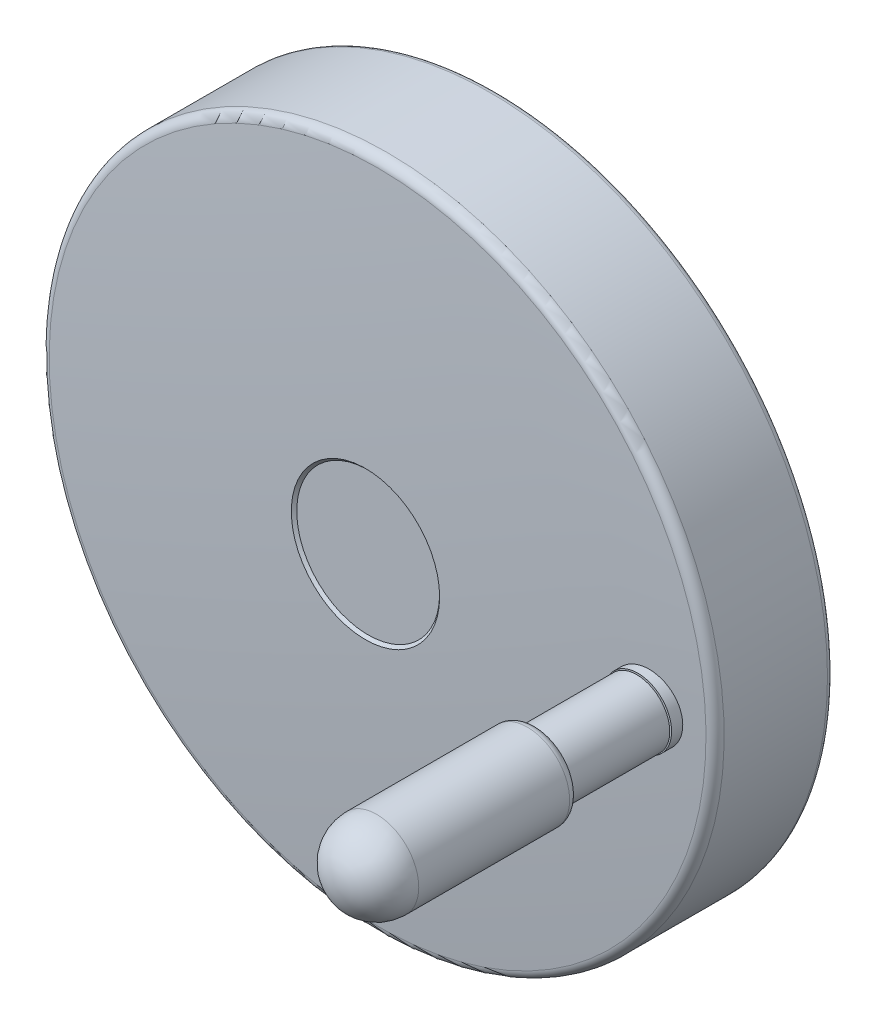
ISO-10303-21;
HEADER;
FILE_DESCRIPTION(('STEP AP214'),'2;1');
FILE_NAME('part.step','',(''),(''),'','','');
FILE_SCHEMA(('AUTOMOTIVE_DESIGN { 1 0 10303 214 1 1 1 1 }'));
ENDSEC;
DATA;
#1=APPLICATION_CONTEXT('core data for automotive mechanical design processes');
#2=APPLICATION_PROTOCOL_DEFINITION('international standard','automotive_design',2000,#1);
#3=PRODUCT_CONTEXT('',#1,'mechanical');
#4=PRODUCT('Part','Part','',(#3));
#5=PRODUCT_RELATED_PRODUCT_CATEGORY('part','',(#4));
#6=PRODUCT_DEFINITION_FORMATION('','',#4);
#7=PRODUCT_DEFINITION_CONTEXT('part definition',#1,'design');
#8=PRODUCT_DEFINITION('design','',#6,#7);
#9=PRODUCT_DEFINITION_SHAPE('','',#8);
#10=(LENGTH_UNIT() NAMED_UNIT(*) SI_UNIT(.MILLI.,.METRE.));
#11=(NAMED_UNIT(*) PLANE_ANGLE_UNIT() SI_UNIT($,.RADIAN.));
#12=(NAMED_UNIT(*) SI_UNIT($,.STERADIAN.) SOLID_ANGLE_UNIT());
#13=UNCERTAINTY_MEASURE_WITH_UNIT(LENGTH_MEASURE(1.E-05),#10,'distance_accuracy_value','');
#14=(GEOMETRIC_REPRESENTATION_CONTEXT(3) GLOBAL_UNCERTAINTY_ASSIGNED_CONTEXT((#13)) GLOBAL_UNIT_ASSIGNED_CONTEXT((#10,
#11,#12)) REPRESENTATION_CONTEXT('',''));
#15=CARTESIAN_POINT('',(0.,0.,0.));
#16=DIRECTION('',(0.,0.,1.));
#17=DIRECTION('',(1.,0.,0.));
#18=AXIS2_PLACEMENT_3D('',#15,#16,#17);
#19=CARTESIAN_POINT('',(0.,0.,53.));
#20=DIRECTION('',(0.,0.,1.));
#21=DIRECTION('',(0.,1.,0.));
#22=AXIS2_PLACEMENT_3D('',#19,#20,#21);
#23=PLANE('',#22);
#24=CARTESIAN_POINT('',(81.,0.,53.));
#25=DIRECTION('',(0.,0.,1.));
#26=DIRECTION('',(0.,1.,0.));
#27=AXIS2_PLACEMENT_3D('',#24,#25,#26);
#28=CIRCLE('',#27,7.3125);
#29=CARTESIAN_POINT('',(81.,7.31249999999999,53.));
#30=VERTEX_POINT('',#29);
#31=EDGE_CURVE('E791',#30,#30,#28,.T.);
#32=ORIENTED_EDGE('',*,*,#31,.F.);
#33=EDGE_LOOP('',(#32));
#34=FACE_BOUND('',#33,.T.);
#35=CARTESIAN_POINT('',(81.,0.,53.));
#36=DIRECTION('',(0.,0.,-1.));
#37=DIRECTION('',(0.,-1.,0.));
#38=AXIS2_PLACEMENT_3D('',#35,#36,#37);
#39=CIRCLE('',#38,10.);
#40=CARTESIAN_POINT('',(81.,-10.,53.));
#41=VERTEX_POINT('',#40);
#42=EDGE_CURVE('E813',#41,#41,#39,.T.);
#43=ORIENTED_EDGE('',*,*,#42,.F.);
#44=EDGE_LOOP('',(#43));
#45=FACE_BOUND('',#44,.T.);
#46=ADVANCED_FACE('F16',(#34,#45),#23,.T.);
#47=CARTESIAN_POINT('',(81.,0.,49.));
#48=DIRECTION('',(0.,0.,-1.));
#49=DIRECTION('',(0.,-1.,0.));
#50=AXIS2_PLACEMENT_3D('',#47,#48,#49);
#51=CYLINDRICAL_SURFACE('',#50,10.);
#52=CARTESIAN_POINT('',(71.,0.,50.9851999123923));
#53=CARTESIAN_POINT('',(71.0000015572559,0.280303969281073,50.9851998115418));
#54=CARTESIAN_POINT('',(71.0117955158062,0.560658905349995,50.9844355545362));
#55=CARTESIAN_POINT('',(71.0589019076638,1.11948955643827,50.9813830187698));
#56=CARTESIAN_POINT('',(71.0942259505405,1.39796427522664,50.9790939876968));
#57=CARTESIAN_POINT('',(71.1882369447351,1.95147310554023,50.973001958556));
#58=CARTESIAN_POINT('',(71.2469678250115,2.22649973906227,50.9691961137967));
#59=CARTESIAN_POINT('',(71.3873705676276,2.77061447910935,50.9600977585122));
#60=CARTESIAN_POINT('',(71.4690430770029,3.03970241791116,50.9548052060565));
#61=CARTESIAN_POINT('',(71.6546550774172,3.56977779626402,50.9427770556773));
#62=CARTESIAN_POINT('',(71.7585742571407,3.83077237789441,50.936042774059));
#63=CARTESIAN_POINT('',(71.9879803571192,4.34307197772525,50.921176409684));
#64=CARTESIAN_POINT('',(72.1134679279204,4.59437670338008,50.9130442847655));
#65=CARTESIAN_POINT('',(72.3850435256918,5.08539078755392,50.8954448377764));
#66=CARTESIAN_POINT('',(72.5311216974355,5.32510562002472,50.8859781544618));
#67=CARTESIAN_POINT('',(72.8428754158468,5.79136990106,50.8657745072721));
#68=CARTESIAN_POINT('',(73.0085505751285,6.01791960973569,50.8550375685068));
#69=CARTESIAN_POINT('',(73.358515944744,6.45650987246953,50.8323569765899));
#70=CARTESIAN_POINT('',(73.5428270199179,6.66853370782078,50.8204119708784));
#71=CARTESIAN_POINT('',(73.928591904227,7.0762955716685,50.7954105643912));
#72=CARTESIAN_POINT('',(74.1300457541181,7.2720335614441,50.7823541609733));
#73=CARTESIAN_POINT('',(74.5486795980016,7.64586313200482,50.7552216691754));
#74=CARTESIAN_POINT('',(74.7658610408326,7.82395308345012,50.7411454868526));
#75=CARTESIAN_POINT('',(75.2143889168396,8.16121532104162,50.7120745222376));
#76=CARTESIAN_POINT('',(75.4457353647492,8.32038758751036,50.69707973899));
#77=CARTESIAN_POINT('',(75.9214132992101,8.61898881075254,50.6662479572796));
#78=CARTESIAN_POINT('',(76.1657691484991,8.75837879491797,50.6504093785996));
#79=CARTESIAN_POINT('',(76.6653145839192,9.01606843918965,50.6180293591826));
#80=CARTESIAN_POINT('',(76.9205041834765,9.13436807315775,50.6014879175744));
#81=CARTESIAN_POINT('',(77.4399046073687,9.34904736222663,50.5678195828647));
#82=CARTESIAN_POINT('',(77.7041154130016,9.44542706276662,50.5506926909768));
#83=CARTESIAN_POINT('',(78.2396856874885,9.61559218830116,50.5159747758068));
#84=CARTESIAN_POINT('',(78.5110451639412,9.68937758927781,50.4983837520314));
#85=CARTESIAN_POINT('',(79.0595035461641,9.81395447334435,50.4628288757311));
#86=CARTESIAN_POINT('',(79.3366122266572,9.86470274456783,50.4448643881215));
#87=CARTESIAN_POINT('',(79.894108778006,9.94264674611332,50.4087220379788));
#88=CARTESIAN_POINT('',(80.1744966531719,9.96984244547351,50.3905441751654));
#89=CARTESIAN_POINT('',(80.7365632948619,10.0004907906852,50.354103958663));
#90=CARTESIAN_POINT('',(81.0182420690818,10.0039432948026,50.3358416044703));
#91=CARTESIAN_POINT('',(81.5808902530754,9.98708070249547,50.2993620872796));
#92=CARTESIAN_POINT('',(81.861859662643,9.96676559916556,50.2811449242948));
#93=CARTESIAN_POINT('',(82.4213543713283,9.90248032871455,50.2448682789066));
#94=CARTESIAN_POINT('',(82.6998771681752,9.85848828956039,50.2268089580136));
#95=CARTESIAN_POINT('',(83.2522337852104,9.7471440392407,50.1909935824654));
#96=CARTESIAN_POINT('',(83.5260676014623,9.67979180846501,50.1732375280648));
#97=CARTESIAN_POINT('',(84.067099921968,9.52219967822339,50.1381549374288));
#98=CARTESIAN_POINT('',(84.3342983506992,9.43195951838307,50.120828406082));
#99=CARTESIAN_POINT('',(84.8601522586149,9.22922695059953,50.0867286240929));
#100=CARTESIAN_POINT('',(85.118807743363,9.11673455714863,50.0699553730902));
#101=CARTESIAN_POINT('',(85.6256350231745,8.87033637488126,50.037088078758));
#102=CARTESIAN_POINT('',(85.8738107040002,8.7364386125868,50.0209937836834));
#103=CARTESIAN_POINT('',(86.3580083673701,8.44814396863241,49.9895927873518));
#104=CARTESIAN_POINT('',(86.594030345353,8.29374707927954,49.9742860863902));
#105=CARTESIAN_POINT('',(87.0522105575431,7.96556018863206,49.9445712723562));
#106=CARTESIAN_POINT('',(87.2743700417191,7.79177193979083,49.9301630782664));
#107=CARTESIAN_POINT('',(87.7032550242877,7.42602184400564,49.902347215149));
#108=CARTESIAN_POINT('',(87.9099805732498,7.23406005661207,49.8889395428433));
#109=CARTESIAN_POINT('',(88.3061598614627,6.83368146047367,49.8632440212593));
#110=CARTESIAN_POINT('',(88.4956436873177,6.62529454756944,49.8509542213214));
#111=CARTESIAN_POINT('',(88.8563971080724,6.19324060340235,49.8275556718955));
#112=CARTESIAN_POINT('',(89.0276663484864,5.96957327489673,49.8164469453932));
#113=CARTESIAN_POINT('',(89.3508311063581,5.5084414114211,49.7954858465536));
#114=CARTESIAN_POINT('',(89.5027174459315,5.27097041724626,49.7856340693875));
#115=CARTESIAN_POINT('',(89.7859220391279,4.78402559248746,49.7672644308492));
#116=CARTESIAN_POINT('',(89.9172409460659,4.53455214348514,49.758746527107));
#117=CARTESIAN_POINT('',(90.1582247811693,4.02567792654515,49.7431151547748));
#118=CARTESIAN_POINT('',(90.2679151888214,3.76628927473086,49.7360000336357));
#119=CARTESIAN_POINT('',(90.4650415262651,3.23916093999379,49.7232132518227));
#120=CARTESIAN_POINT('',(90.5524781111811,2.97142150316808,49.7175415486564));
#121=CARTESIAN_POINT('',(90.7043244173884,2.43001873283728,49.7076917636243));
#122=CARTESIAN_POINT('',(90.7687774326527,2.15636757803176,49.7035108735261));
#123=CARTESIAN_POINT('',(90.8743983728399,1.60470199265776,49.6966595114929));
#124=CARTESIAN_POINT('',(90.9155778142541,1.32668979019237,49.6939882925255));
#125=CARTESIAN_POINT('',(90.9633102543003,0.8735345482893,49.6908919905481));
#126=CARTESIAN_POINT('',(90.9770645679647,0.69912160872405,49.6899997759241));
#127=CARTESIAN_POINT('',(90.9954099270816,0.349812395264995,49.6888097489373));
#128=CARTESIAN_POINT('',(91.0000009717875,0.174916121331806,49.6885119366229));
#129=CARTESIAN_POINT('',(90.99999844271,-0.280303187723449,49.6885121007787));
#130=CARTESIAN_POINT('',(90.9882045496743,-0.560657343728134,49.6892771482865));
#131=CARTESIAN_POINT('',(90.9410984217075,-1.11948643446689,49.6923328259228));
#132=CARTESIAN_POINT('',(90.9057745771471,-1.39796037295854,49.6946242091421));
#133=CARTESIAN_POINT('',(90.8117641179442,-1.95146764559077,49.700722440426));
#134=CARTESIAN_POINT('',(90.7530335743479,-2.22649350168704,49.7045321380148));
#135=CARTESIAN_POINT('',(90.6126316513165,-2.77060669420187,49.7136395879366));
#136=CARTESIAN_POINT('',(90.5309596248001,-3.0396938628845,49.7189373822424));
#137=CARTESIAN_POINT('',(90.3453487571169,-3.56976768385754,49.7309772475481));
#138=CARTESIAN_POINT('',(90.2414302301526,-3.83076147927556,49.7377180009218));
#139=CARTESIAN_POINT('',(90.0120256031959,-4.3430595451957,49.752598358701));
#140=CARTESIAN_POINT('',(89.8865388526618,-4.59436352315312,49.7607380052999));
#141=CARTESIAN_POINT('',(89.6149650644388,-5.08537617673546,49.778353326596));
#142=CARTESIAN_POINT('',(89.4688878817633,-5.32509032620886,49.7878283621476));
#143=CARTESIAN_POINT('',(89.1571363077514,-5.79135333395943,49.8080493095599));
#144=CARTESIAN_POINT('',(88.9914623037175,-6.01790245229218,49.818795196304));
#145=CARTESIAN_POINT('',(88.6414989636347,-6.45649220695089,49.8414940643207));
#146=CARTESIAN_POINT('',(88.4571887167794,-6.66851608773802,49.8534484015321));
#147=CARTESIAN_POINT('',(88.0714255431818,-7.0762781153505,49.8784685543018));
#148=CARTESIAN_POINT('',(87.8699725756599,-7.27201622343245,49.8915343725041));
#149=CARTESIAN_POINT('',(87.4513405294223,-7.64584612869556,49.9186855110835));
#150=CARTESIAN_POINT('',(87.2341600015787,-7.82393629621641,49.9327709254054));
#151=CARTESIAN_POINT('',(86.78563396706,-8.16119907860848,49.9618599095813));
#152=CARTESIAN_POINT('',(86.554288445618,-8.32037167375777,49.9768634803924));
#153=CARTESIAN_POINT('',(86.0786114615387,-8.61897423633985,50.0077122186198));
#154=CARTESIAN_POINT('',(85.8342555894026,-8.75836515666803,50.0235589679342));
#155=CARTESIAN_POINT('',(85.3347099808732,-9.01605664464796,50.0559544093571));
#156=CARTESIAN_POINT('',(85.0795202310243,-9.13435718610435,50.0725031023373));
#157=CARTESIAN_POINT('',(84.5601193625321,-9.34903825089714,50.1061848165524));
#158=CARTESIAN_POINT('',(84.2959082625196,-9.44541881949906,50.1233178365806));
#159=CARTESIAN_POINT('',(83.760337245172,-9.61558562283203,50.1580467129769));
#160=CARTESIAN_POINT('',(83.4889773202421,-9.68937183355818,50.1756425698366));
#161=CARTESIAN_POINT('',(82.9405177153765,-9.81395029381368,50.211205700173));
#162=CARTESIAN_POINT('',(82.6634082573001,-9.86469931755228,50.2291736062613));
#163=CARTESIAN_POINT('',(82.1059099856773,-9.94264468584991,50.2653212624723));
#164=CARTESIAN_POINT('',(81.8255211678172,-9.96984099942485,50.2835010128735));
#165=CARTESIAN_POINT('',(81.2634524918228,-10.0004904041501,50.3199434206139));
#166=CARTESIAN_POINT('',(80.9817726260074,-10.0039433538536,50.3382060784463));
#167=CARTESIAN_POINT('',(80.4191221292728,-9.98708145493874,50.374684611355));
#168=CARTESIAN_POINT('',(80.1381514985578,-9.9667665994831,50.3929004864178));
#169=CARTESIAN_POINT('',(79.5786551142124,-9.90248170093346,50.4291729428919));
#170=CARTESIAN_POINT('',(79.3001318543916,-9.85848985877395,50.4472293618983));
#171=CARTESIAN_POINT('',(78.7477742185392,-9.74714590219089,50.4830374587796));
#172=CARTESIAN_POINT('',(78.4739398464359,-9.67979376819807,50.5007891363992));
#173=CARTESIAN_POINT('',(77.9329063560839,-9.52220171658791,50.5358616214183));
#174=CARTESIAN_POINT('',(77.6657073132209,-9.43196153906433,50.5531824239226));
#175=CARTESIAN_POINT('',(77.1398521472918,-9.22922881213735,50.5872695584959));
#176=CARTESIAN_POINT('',(76.8811960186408,-9.11673627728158,50.6040358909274));
#177=CARTESIAN_POINT('',(76.3743684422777,-8.87033816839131,50.6368882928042));
#178=CARTESIAN_POINT('',(76.1261930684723,-8.73644070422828,50.652974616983));
#179=CARTESIAN_POINT('',(75.6419959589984,-8.44814669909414,50.6843589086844));
#180=CARTESIAN_POINT('',(75.4059742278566,-8.29375015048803,50.6996568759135));
#181=CARTESIAN_POINT('',(74.9477944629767,-7.96556398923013,50.7293537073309));
#182=CARTESIAN_POINT('',(74.7256351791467,-7.79177612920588,50.7437526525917));
#183=CARTESIAN_POINT('',(74.2967505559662,-7.42602686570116,50.7715497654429));
#184=CARTESIAN_POINT('',(74.090025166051,-7.23406552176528,50.7849479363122));
#185=CARTESIAN_POINT('',(73.6938463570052,-6.83368807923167,50.8106244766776));
#186=CARTESIAN_POINT('',(73.50436283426,-6.62530189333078,50.8229047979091));
#187=CARTESIAN_POINT('',(73.1436099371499,-6.19324950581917,50.8462846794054));
#188=CARTESIAN_POINT('',(72.9723409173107,-5.96958300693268,50.8573842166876));
#189=CARTESIAN_POINT('',(72.6491765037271,-5.50845290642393,50.8783274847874));
#190=CARTESIAN_POINT('',(72.4972902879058,-5.27098284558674,50.8881706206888));
#191=CARTESIAN_POINT('',(72.2140858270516,-4.78403998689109,50.9065237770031));
#192=CARTESIAN_POINT('',(72.0827669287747,-4.53456757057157,50.9150338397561));
#193=CARTESIAN_POINT('',(71.8417826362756,-4.02569478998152,50.9306505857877));
#194=CARTESIAN_POINT('',(71.7320918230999,-3.76630651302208,50.9377589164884));
#195=CARTESIAN_POINT('',(71.5349646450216,-3.23917895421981,50.9505333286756));
#196=CARTESIAN_POINT('',(71.4475276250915,-2.9714399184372,50.9561994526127));
#197=CARTESIAN_POINT('',(71.2956804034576,-2.43003795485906,50.9660394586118));
#198=CARTESIAN_POINT('',(71.2312269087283,-2.15638720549,50.9702161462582));
#199=CARTESIAN_POINT('',(71.1256049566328,-1.60472242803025,50.9770605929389));
#200=CARTESIAN_POINT('',(71.0844249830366,-1.32671062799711,50.9797290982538));
#201=CARTESIAN_POINT('',(71.0366912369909,-0.873552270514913,50.9828222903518));
#202=CARTESIAN_POINT('',(71.0229363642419,-0.699135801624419,50.9837136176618));
#203=CARTESIAN_POINT('',(71.0045902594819,-0.349819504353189,50.9849024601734));
#204=CARTESIAN_POINT('',(70.9999990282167,-0.174919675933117,50.9851999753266));
#205=CARTESIAN_POINT('',(71.,0.,50.9851999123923));
#206=B_SPLINE_CURVE_WITH_KNOTS('',3,(#52,#53,#54,#55,#56,#57,#58,#59,#60,#61,#62,#63,#64,#65,
#66,#67,#68,#69,#70,#71,#72,#73,#74,#75,#76,#77,#78,#79,#80,#81,#82,#83,#84,#85,#86,#87,#88,#89,
#90,#91,#92,#93,#94,#95,#96,#97,#98,#99,#100,#101,#102,#103,#104,#105,#106,#107,#108,#109,#110,
#111,#112,#113,#114,#115,#116,#117,#118,#119,#120,#121,#122,#123,#124,#125,#126,#127,#128,#129,
#130,#131,#132,#133,#134,#135,#136,#137,#138,#139,#140,#141,#142,#143,#144,#145,#146,#147,#148,
#149,#150,#151,#152,#153,#154,#155,#156,#157,#158,#159,#160,#161,#162,#163,#164,#165,#166,#167,
#168,#169,#170,#171,#172,#173,#174,#175,#176,#177,#178,#179,#180,#181,#182,#183,#184,#185,#186,
#187,#188,#189,#190,#191,#192,#193,#194,#195,#196,#197,#198,#199,#200,#201,#202,#203,#204,#205),
.UNSPECIFIED.,.T.,.F.,(4,2,2,2,2,2,2,2,2,2,2,2,2,2,2,2,2,2,2,2,2,2,2,2,2,2,2,2,2,2,2,2,2,2,2,2,
2,2,2,2,2,2,2,2,2,2,2,2,2,2,2,2,2,2,2,2,2,2,2,2,2,2,2,2,2,2,2,2,2,2,2,2,2,2,2,2,4),(0.,
0.840751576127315,1.68191828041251,2.52467114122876,3.36744777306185,4.20945820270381,
5.05149403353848,5.8931282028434,6.73474573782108,7.57731621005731,8.41988868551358,
9.26253887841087,10.1051899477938,10.9494787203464,11.793768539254,12.6380566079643,
13.4823455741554,14.3282117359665,15.1740790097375,16.0199513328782,16.8658239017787,
17.7124792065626,18.5591352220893,19.405800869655,20.2524659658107,21.0988143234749,
21.9451629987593,22.7914352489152,23.6377047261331,24.4824679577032,25.3272476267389,
26.1724258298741,27.0175771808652,27.8617268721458,28.7058517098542,29.5483779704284,
30.3904869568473,30.9151352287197,31.4397835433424,32.280532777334,33.1216971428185,
33.964447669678,34.8072219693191,35.6492299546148,36.4912633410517,37.3328950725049,
38.1745101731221,39.0170803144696,39.8596524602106,40.7023023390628,41.5449530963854,
42.3892446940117,43.2335373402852,44.0778282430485,44.9221200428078,45.7679895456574,
46.6138601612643,47.4597358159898,48.3056117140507,49.1522677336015,49.9989244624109,
50.8455908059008,51.6922565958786,52.5386023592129,53.3849484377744,54.2312180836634,
55.0774849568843,55.9222447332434,56.7670209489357,57.6121957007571,58.4573436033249,
59.3014922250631,60.1456159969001,60.9881412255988,61.8302491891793,62.3549081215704,
62.8795670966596),.UNSPECIFIED.);
#207=CARTESIAN_POINT('',(71.,0.,50.9851999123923));
#208=VERTEX_POINT('',#207);
#209=EDGE_CURVE('E795',#208,#208,#206,.T.);
#210=ORIENTED_EDGE('',*,*,#209,.F.);
#211=EDGE_LOOP('',(#210));
#212=FACE_BOUND('',#211,.T.);
#213=ORIENTED_EDGE('',*,*,#42,.T.);
#214=EDGE_LOOP('',(#213));
#215=FACE_BOUND('',#214,.T.);
#216=ADVANCED_FACE('F636',(#212,#215),#51,.T.);
#217=CARTESIAN_POINT('',(0.,0.,-1198.99999999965));
#218=DIRECTION('',(-1.,0.,0.));
#219=DIRECTION('',(0.,0.,1.));
#220=AXIS2_PLACEMENT_3D('',#217,#218,#219);
#221=SPHERICAL_SURFACE('',#220,1251.99999999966);
#222=CARTESIAN_POINT('',(0.,0.,49.2042137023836));
#223=DIRECTION('',(0.,0.,1.));
#224=DIRECTION('',(0.,1.,0.));
#225=AXIS2_PLACEMENT_3D('',#222,#223,#224);
#226=CIRCLE('',#225,97.4178674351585);
#227=CARTESIAN_POINT('',(0.,97.4178674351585,49.2042137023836));
#228=VERTEX_POINT('',#227);
#229=EDGE_CURVE('E788',#228,#228,#226,.T.);
#230=ORIENTED_EDGE('',*,*,#229,.T.);
#231=EDGE_LOOP('',(#230));
#232=FACE_BOUND('',#231,.T.);
#233=CARTESIAN_POINT('',(0.,0.,52.8066943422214));
#234=DIRECTION('',(0.,0.,1.));
#235=DIRECTION('',(1.,0.,0.));
#236=AXIS2_PLACEMENT_3D('',#233,#234,#235);
#237=CIRCLE('',#236,21.9999999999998);
#238=CARTESIAN_POINT('',(21.9999999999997,0.,52.8066943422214));
#239=VERTEX_POINT('',#238);
#240=EDGE_CURVE('E792',#239,#239,#237,.F.);
#241=ORIENTED_EDGE('',*,*,#240,.T.);
#242=EDGE_LOOP('',(#241));
#243=FACE_BOUND('',#242,.T.);
#244=ORIENTED_EDGE('',*,*,#209,.T.);
#245=EDGE_LOOP('',(#244));
#246=FACE_BOUND('',#245,.T.);
#247=ADVANCED_FACE('F627',(#232,#243,#246),#221,.T.);
#248=CARTESIAN_POINT('',(0.,0.,46.4127026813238));
#249=DIRECTION('',(0.,0.,1.));
#250=DIRECTION('',(0.,1.,0.));
#251=AXIS2_PLACEMENT_3D('',#248,#249,#250);
#252=TOROIDAL_SURFACE('',#251,97.2,2.80000000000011);
#253=CARTESIAN_POINT('',(0.,0.,46.4127026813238));
#254=DIRECTION('',(0.,0.,1.));
#255=DIRECTION('',(0.,1.,0.));
#256=AXIS2_PLACEMENT_3D('',#253,#254,#255);
#257=CIRCLE('',#256,100.);
#258=CARTESIAN_POINT('',(0.,100.,46.4127026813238));
#259=VERTEX_POINT('',#258);
#260=EDGE_CURVE('E801',#259,#259,#257,.T.);
#261=ORIENTED_EDGE('',*,*,#260,.T.);
#262=EDGE_LOOP('',(#261));
#263=FACE_BOUND('',#262,.T.);
#264=ORIENTED_EDGE('',*,*,#229,.F.);
#265=EDGE_LOOP('',(#264));
#266=FACE_BOUND('',#265,.T.);
#267=ADVANCED_FACE('F618',(#263,#266),#252,.T.);
#268=CARTESIAN_POINT('',(0.,0.,52.8066943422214));
#269=DIRECTION('',(0.,0.,1.));
#270=DIRECTION('',(1.,0.,0.));
#271=AXIS2_PLACEMENT_3D('',#268,#269,#270);
#272=CONICAL_SURFACE('',#271,22.,0.785398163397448);
#273=CARTESIAN_POINT('',(0.,0.,52.));
#274=DIRECTION('',(0.,0.,1.));
#275=DIRECTION('',(1.,0.,0.));
#276=AXIS2_PLACEMENT_3D('',#273,#274,#275);
#277=CIRCLE('',#276,21.1933056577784);
#278=CARTESIAN_POINT('',(21.1933056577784,0.,52.));
#279=VERTEX_POINT('',#278);
#280=EDGE_CURVE('E802',#279,#279,#277,.T.);
#281=ORIENTED_EDGE('',*,*,#280,.F.);
#282=EDGE_LOOP('',(#281));
#283=FACE_BOUND('',#282,.T.);
#284=ORIENTED_EDGE('',*,*,#240,.F.);
#285=EDGE_LOOP('',(#284));
#286=FACE_BOUND('',#285,.T.);
#287=ADVANCED_FACE('F609',(#283,#286),#272,.F.);
#288=CARTESIAN_POINT('',(0.,0.,31.0813513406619));
#289=DIRECTION('',(0.,0.,-1.));
#290=DIRECTION('',(-1.,0.,0.));
#291=AXIS2_PLACEMENT_3D('',#288,#289,#290);
#292=CYLINDRICAL_SURFACE('',#291,100.);
#293=CARTESIAN_POINT('',(0.,0.,15.75));
#294=DIRECTION('',(0.,0.,-1.));
#295=DIRECTION('',(-1.,0.,0.));
#296=AXIS2_PLACEMENT_3D('',#293,#294,#295);
#297=CIRCLE('',#296,100.);
#298=CARTESIAN_POINT('',(-100.,0.,15.75));
#299=VERTEX_POINT('',#298);
#300=EDGE_CURVE('E699',#299,#299,#297,.F.);
#301=ORIENTED_EDGE('',*,*,#300,.T.);
#302=EDGE_LOOP('',(#301));
#303=FACE_BOUND('',#302,.T.);
#304=ORIENTED_EDGE('',*,*,#260,.F.);
#305=EDGE_LOOP('',(#304));
#306=FACE_BOUND('',#305,.T.);
#307=ADVANCED_FACE('F600',(#303,#306),#292,.T.);
#308=CARTESIAN_POINT('',(-10.5966528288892,0.,52.));
#309=DIRECTION('',(0.,0.,1.));
#310=DIRECTION('',(0.,1.,0.));
#311=AXIS2_PLACEMENT_3D('',#308,#309,#310);
#312=PLANE('',#311);
#313=ORIENTED_EDGE('',*,*,#280,.T.);
#314=EDGE_LOOP('',(#313));
#315=FACE_BOUND('',#314,.T.);
#316=ADVANCED_FACE('F591',(#315),#312,.T.);
#317=CARTESIAN_POINT('',(0.,0.,15.75));
#318=DIRECTION('',(0.,0.,1.));
#319=DIRECTION('',(0.,1.,0.));
#320=AXIS2_PLACEMENT_3D('',#317,#318,#319);
#321=TOROIDAL_SURFACE('',#320,98.25,1.75);
#322=ORIENTED_EDGE('',*,*,#300,.F.);
#323=EDGE_LOOP('',(#322));
#324=FACE_BOUND('',#323,.T.);
#325=CARTESIAN_POINT('',(0.,0.,14.));
#326=DIRECTION('',(0.,0.,1.));
#327=DIRECTION('',(0.,-1.,0.));
#328=AXIS2_PLACEMENT_3D('',#325,#326,#327);
#329=CIRCLE('',#328,98.25);
#330=CARTESIAN_POINT('',(0.,-98.25,14.0000000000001));
#331=VERTEX_POINT('',#330);
#332=CARTESIAN_POINT('',(0.,98.25,14.0000000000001));
#333=VERTEX_POINT('',#332);
#334=EDGE_CURVE('E724',#331,#333,#329,.T.);
#335=ORIENTED_EDGE('',*,*,#334,.T.);
#336=CARTESIAN_POINT('',(0.,0.,14.));
#337=DIRECTION('',(0.,0.,1.));
#338=DIRECTION('',(0.,1.,0.));
#339=AXIS2_PLACEMENT_3D('',#336,#337,#338);
#340=CIRCLE('',#339,98.25);
#341=CARTESIAN_POINT('',(-98.25,0.,14.));
#342=VERTEX_POINT('',#341);
#343=EDGE_CURVE('E744',#333,#342,#340,.T.);
#344=ORIENTED_EDGE('',*,*,#343,.T.);
#345=CARTESIAN_POINT('',(0.,0.,14.));
#346=DIRECTION('',(0.,0.,1.));
#347=DIRECTION('',(-1.,0.,0.));
#348=AXIS2_PLACEMENT_3D('',#345,#346,#347);
#349=CIRCLE('',#348,98.25);
#350=EDGE_CURVE('E36',#342,#331,#349,.T.);
#351=ORIENTED_EDGE('',*,*,#350,.T.);
#352=EDGE_LOOP('',(#335,#344,#351));
#353=FACE_BOUND('',#352,.T.);
#354=ADVANCED_FACE('F582',(#324,#353),#321,.T.);
#355=CARTESIAN_POINT('',(-97.125,0.,14.));
#356=DIRECTION('',(0.,0.,-1.));
#357=DIRECTION('',(-1.,0.,0.));
#358=AXIS2_PLACEMENT_3D('',#355,#356,#357);
#359=PLANE('',#358);
#360=CARTESIAN_POINT('',(0.,0.,14.));
#361=DIRECTION('',(0.,0.,-1.));
#362=DIRECTION('',(-1.,0.,0.));
#363=AXIS2_PLACEMENT_3D('',#360,#361,#362);
#364=CIRCLE('',#363,96.);
#365=CARTESIAN_POINT('',(-96.,0.,14.));
#366=VERTEX_POINT('',#365);
#367=EDGE_CURVE('E745',#366,#366,#364,.F.);
#368=ORIENTED_EDGE('',*,*,#367,.T.);
#369=EDGE_LOOP('',(#368));
#370=FACE_BOUND('',#369,.T.);
#371=ORIENTED_EDGE('',*,*,#343,.F.);
#372=ORIENTED_EDGE('',*,*,#334,.F.);
#373=ORIENTED_EDGE('',*,*,#350,.F.);
#374=EDGE_LOOP('',(#371,#372,#373));
#375=FACE_BOUND('',#374,.T.);
#376=ADVANCED_FACE('F574',(#370,#375),#359,.T.);
#377=CARTESIAN_POINT('',(0.,0.,17.6));
#378=DIRECTION('',(0.,0.,-1.));
#379=DIRECTION('',(-1.,0.,0.));
#380=AXIS2_PLACEMENT_3D('',#377,#378,#379);
#381=CYLINDRICAL_SURFACE('',#380,96.);
#382=ORIENTED_EDGE('',*,*,#367,.F.);
#383=EDGE_LOOP('',(#382));
#384=FACE_BOUND('',#383,.T.);
#385=CARTESIAN_POINT('',(0.,0.,21.2));
#386=DIRECTION('',(0.,0.,-1.));
#387=DIRECTION('',(-1.,0.,0.));
#388=AXIS2_PLACEMENT_3D('',#385,#386,#387);
#389=CIRCLE('',#388,96.);
#390=CARTESIAN_POINT('',(-96.,0.,21.2));
#391=VERTEX_POINT('',#390);
#392=EDGE_CURVE('E749',#391,#391,#389,.T.);
#393=ORIENTED_EDGE('',*,*,#392,.F.);
#394=EDGE_LOOP('',(#393));
#395=FACE_BOUND('',#394,.T.);
#396=ADVANCED_FACE('F565',(#384,#395),#381,.F.);
#397=CARTESIAN_POINT('',(81.,0.,39.75));
#398=DIRECTION('',(0.,0.,1.));
#399=DIRECTION('',(0.,1.,0.));
#400=AXIS2_PLACEMENT_3D('',#397,#398,#399);
#401=CYLINDRICAL_SURFACE('',#400,4.188);
#402=CARTESIAN_POINT('',(81.,0.,36.1079999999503));
#403=DIRECTION('',(0.,0.,1.));
#404=DIRECTION('',(0.,1.,0.));
#405=AXIS2_PLACEMENT_3D('',#402,#403,#404);
#406=CIRCLE('',#405,4.188);
#407=CARTESIAN_POINT('',(81.,4.18799999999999,36.1079999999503));
#408=VERTEX_POINT('',#407);
#409=EDGE_CURVE('E9',#408,#408,#406,.T.);
#410=ORIENTED_EDGE('',*,*,#409,.T.);
#411=EDGE_LOOP('',(#410));
#412=FACE_BOUND('',#411,.T.);
#413=CARTESIAN_POINT('',(81.,0.,27.312));
#414=DIRECTION('',(0.,0.,1.));
#415=DIRECTION('',(0.,1.,0.));
#416=AXIS2_PLACEMENT_3D('',#413,#414,#415);
#417=CIRCLE('',#416,4.188);
#418=CARTESIAN_POINT('',(81.,4.188,27.312));
#419=VERTEX_POINT('',#418);
#420=EDGE_CURVE('E746',#419,#419,#417,.T.);
#421=ORIENTED_EDGE('',*,*,#420,.F.);
#422=EDGE_LOOP('',(#421));
#423=FACE_BOUND('',#422,.T.);
#424=ADVANCED_FACE('F555',(#412,#423),#401,.F.);
#425=CARTESIAN_POINT('',(81.,0.,26.5000000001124));
#426=DIRECTION('',(0.,0.,-1.));
#427=DIRECTION('',(0.,-1.,0.));
#428=AXIS2_PLACEMENT_3D('',#425,#426,#427);
#429=CONICAL_SURFACE('',#428,4.99999999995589,0.785398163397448);
#430=ORIENTED_EDGE('',*,*,#420,.T.);
#431=EDGE_LOOP('',(#430));
#432=FACE_BOUND('',#431,.T.);
#433=CARTESIAN_POINT('',(81.,0.,26.4999999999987));
#434=DIRECTION('',(0.,0.,-1.));
#435=DIRECTION('',(0.,-1.,0.));
#436=AXIS2_PLACEMENT_3D('',#433,#434,#435);
#437=CIRCLE('',#436,5.00000000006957);
#438=CARTESIAN_POINT('',(81.,-5.00000000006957,26.4999999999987));
#439=VERTEX_POINT('',#438);
#440=EDGE_CURVE('E752',#439,#439,#437,.F.);
#441=ORIENTED_EDGE('',*,*,#440,.F.);
#442=EDGE_LOOP('',(#441));
#443=FACE_BOUND('',#442,.T.);
#444=ADVANCED_FACE('F547',(#432,#443),#429,.F.);
#445=CARTESIAN_POINT('',(86.5,0.,26.5));
#446=DIRECTION('',(0.,0.,1.));
#447=DIRECTION('',(0.,1.,0.));
#448=AXIS2_PLACEMENT_3D('',#445,#446,#447);
#449=PLANE('',#448);
#450=ORIENTED_EDGE('',*,*,#440,.T.);
#451=EDGE_LOOP('',(#450));
#452=FACE_BOUND('',#451,.T.);
#453=CARTESIAN_POINT('',(81.,0.,26.5));
#454=DIRECTION('',(0.,0.,1.));
#455=DIRECTION('',(0.,1.,0.));
#456=AXIS2_PLACEMENT_3D('',#453,#454,#455);
#457=CIRCLE('',#456,6.);
#458=CARTESIAN_POINT('',(81.,6.,26.5));
#459=VERTEX_POINT('',#458);
#460=EDGE_CURVE('E756',#459,#459,#457,.T.);
#461=ORIENTED_EDGE('',*,*,#460,.F.);
#462=EDGE_LOOP('',(#461));
#463=FACE_BOUND('',#462,.T.);
#464=ADVANCED_FACE('F539',(#452,#463),#449,.F.);
#465=CARTESIAN_POINT('',(81.,0.,13.25));
#466=DIRECTION('',(0.,0.,1.));
#467=DIRECTION('',(0.,1.,0.));
#468=AXIS2_PLACEMENT_3D('',#465,#466,#467);
#469=CYLINDRICAL_SURFACE('',#468,6.);
#470=CARTESIAN_POINT('',(81.,0.,21.2));
#471=DIRECTION('',(0.,0.,1.));
#472=DIRECTION('',(0.,1.,0.));
#473=AXIS2_PLACEMENT_3D('',#470,#471,#472);
#474=CIRCLE('',#473,6.);
#475=CARTESIAN_POINT('',(81.,6.,21.2));
#476=VERTEX_POINT('',#475);
#477=EDGE_CURVE('E760',#476,#476,#474,.T.);
#478=ORIENTED_EDGE('',*,*,#477,.F.);
#479=EDGE_LOOP('',(#478));
#480=FACE_BOUND('',#479,.T.);
#481=ORIENTED_EDGE('',*,*,#460,.T.);
#482=EDGE_LOOP('',(#481));
#483=FACE_BOUND('',#482,.T.);
#484=ADVANCED_FACE('F530',(#480,#483),#469,.F.);
#485=CARTESIAN_POINT('',(-80.2983075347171,0.,21.2));
#486=DIRECTION('',(0.,0.,-1.));
#487=DIRECTION('',(0.,-1.,0.));
#488=AXIS2_PLACEMENT_3D('',#485,#486,#487);
#489=PLANE('',#488);
#490=CARTESIAN_POINT('',(0.,0.,21.2));
#491=DIRECTION('',(0.,0.,-1.));
#492=DIRECTION('',(-1.,0.,0.));
#493=AXIS2_PLACEMENT_3D('',#490,#491,#492);
#494=CIRCLE('',#493,69.);
#495=CARTESIAN_POINT('',(-69.,0.,21.2));
#496=VERTEX_POINT('',#495);
#497=EDGE_CURVE('E764',#496,#496,#494,.F.);
#498=ORIENTED_EDGE('',*,*,#497,.T.);
#499=EDGE_LOOP('',(#498));
#500=FACE_BOUND('',#499,.T.);
#501=CARTESIAN_POINT('',(0.,0.,21.2));
#502=DIRECTION('',(0.,0.,1.));
#503=DIRECTION('',(1.,0.,0.));
#504=AXIS2_PLACEMENT_3D('',#501,#502,#503);
#505=CIRCLE('',#504,91.5966150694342);
#506=CARTESIAN_POINT('',(91.5966150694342,0.,21.2));
#507=VERTEX_POINT('',#506);
#508=EDGE_CURVE('E831',#507,#507,#505,.T.);
#509=ORIENTED_EDGE('',*,*,#508,.F.);
#510=EDGE_LOOP('',(#509));
#511=FACE_BOUND('',#510,.T.);
#512=ORIENTED_EDGE('',*,*,#477,.T.);
#513=EDGE_LOOP('',(#512));
#514=FACE_BOUND('',#513,.T.);
#515=ADVANCED_FACE('F521',(#500,#511,#514),#489,.T.);
#516=CARTESIAN_POINT('',(0.,0.,21.2));
#517=DIRECTION('',(0.,0.,-1.));
#518=DIRECTION('',(-1.,0.,0.));
#519=AXIS2_PLACEMENT_3D('',#516,#517,#518);
#520=CONICAL_SURFACE('',#519,69.,0.785398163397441);
#521=ORIENTED_EDGE('',*,*,#497,.F.);
#522=EDGE_LOOP('',(#521));
#523=FACE_BOUND('',#522,.T.);
#524=CARTESIAN_POINT('',(0.,0.,22.2));
#525=DIRECTION('',(0.,0.,-1.));
#526=DIRECTION('',(-1.,0.,0.));
#527=AXIS2_PLACEMENT_3D('',#524,#525,#526);
#528=CIRCLE('',#527,68.);
#529=CARTESIAN_POINT('',(-68.,0.,22.2));
#530=VERTEX_POINT('',#529);
#531=EDGE_CURVE('E761',#530,#530,#528,.T.);
#532=ORIENTED_EDGE('',*,*,#531,.F.);
#533=EDGE_LOOP('',(#532));
#534=FACE_BOUND('',#533,.T.);
#535=ADVANCED_FACE('F512',(#523,#534),#520,.F.);
#536=CARTESIAN_POINT('',(0.,0.,37.2407631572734));
#537=DIRECTION('',(0.,0.,1.));
#538=DIRECTION('',(1.,0.,0.));
#539=AXIS2_PLACEMENT_3D('',#536,#537,#538);
#540=CONICAL_SURFACE('',#539,93.,0.0872664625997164);
#541=CARTESIAN_POINT('',(0.,0.,37.2407631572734));
#542=DIRECTION('',(0.,0.,-1.));
#543=DIRECTION('',(-1.,0.,0.));
#544=AXIS2_PLACEMENT_3D('',#541,#542,#543);
#545=CIRCLE('',#544,93.);
#546=CARTESIAN_POINT('',(-93.,0.,37.2407631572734));
#547=VERTEX_POINT('',#546);
#548=EDGE_CURVE('E757',#547,#547,#545,.T.);
#549=ORIENTED_EDGE('',*,*,#548,.T.);
#550=EDGE_LOOP('',(#549));
#551=FACE_BOUND('',#550,.T.);
#552=ORIENTED_EDGE('',*,*,#508,.T.);
#553=EDGE_LOOP('',(#552));
#554=FACE_BOUND('',#553,.T.);
#555=ADVANCED_FACE('F504',(#551,#554),#540,.T.);
#556=CARTESIAN_POINT('',(0.,0.,29.5846208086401));
#557=DIRECTION('',(0.,0.,-1.));
#558=DIRECTION('',(-1.,0.,0.));
#559=AXIS2_PLACEMENT_3D('',#556,#557,#558);
#560=CYLINDRICAL_SURFACE('',#559,68.);
#561=ORIENTED_EDGE('',*,*,#531,.T.);
#562=EDGE_LOOP('',(#561));
#563=FACE_BOUND('',#562,.T.);
#564=CARTESIAN_POINT('',(0.,0.,36.9692416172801));
#565=DIRECTION('',(0.,0.,-1.));
#566=DIRECTION('',(-1.,0.,0.));
#567=AXIS2_PLACEMENT_3D('',#564,#565,#566);
#568=CIRCLE('',#567,68.);
#569=CARTESIAN_POINT('',(-68.,0.,36.9692416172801));
#570=VERTEX_POINT('',#569);
#571=EDGE_CURVE('E765',#570,#570,#568,.T.);
#572=ORIENTED_EDGE('',*,*,#571,.F.);
#573=EDGE_LOOP('',(#572));
#574=FACE_BOUND('',#573,.T.);
#575=ADVANCED_FACE('F495',(#563,#574),#560,.F.);
#576=CARTESIAN_POINT('',(0.,0.,37.1));
#577=DIRECTION('',(0.,0.,-1.));
#578=DIRECTION('',(-1.,0.,0.));
#579=AXIS2_PLACEMENT_3D('',#576,#577,#578);
#580=CONICAL_SURFACE('',#579,94.6089302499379,1.48352986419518);
#581=CARTESIAN_POINT('',(0.,0.,37.1));
#582=DIRECTION('',(0.,0.,-1.));
#583=DIRECTION('',(-1.,0.,0.));
#584=AXIS2_PLACEMENT_3D('',#581,#582,#583);
#585=CIRCLE('',#584,94.6089302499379);
#586=CARTESIAN_POINT('',(-94.6089302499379,0.,37.0999999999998));
#587=VERTEX_POINT('',#586);
#588=EDGE_CURVE('E753',#587,#587,#585,.T.);
#589=ORIENTED_EDGE('',*,*,#588,.T.);
#590=EDGE_LOOP('',(#589));
#591=FACE_BOUND('',#590,.T.);
#592=ORIENTED_EDGE('',*,*,#548,.F.);
#593=EDGE_LOOP('',(#592));
#594=FACE_BOUND('',#593,.T.);
#595=ADVANCED_FACE('F485',(#591,#594),#580,.F.);
#596=CARTESIAN_POINT('',(0.,0.,36.9692416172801));
#597=DIRECTION('',(0.,0.,1.));
#598=DIRECTION('',(0.,1.,0.));
#599=AXIS2_PLACEMENT_3D('',#596,#597,#598);
#600=TOROIDAL_SURFACE('',#599,65.6666666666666,2.33333333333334);
#601=CARTESIAN_POINT('',(0.,0.,39.2671263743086));
#602=DIRECTION('',(0.,0.,1.));
#603=DIRECTION('',(0.,1.,0.));
#604=AXIS2_PLACEMENT_3D('',#601,#602,#603);
#605=CIRCLE('',#604,65.2614875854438);
#606=CARTESIAN_POINT('',(0.,65.2614875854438,39.2671263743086));
#607=VERTEX_POINT('',#606);
#608=EDGE_CURVE('E768',#607,#607,#605,.F.);
#609=ORIENTED_EDGE('',*,*,#608,.F.);
#610=EDGE_LOOP('',(#609));
#611=FACE_BOUND('',#610,.T.);
#612=ORIENTED_EDGE('',*,*,#571,.T.);
#613=EDGE_LOOP('',(#612));
#614=FACE_BOUND('',#613,.T.);
#615=ADVANCED_FACE('F475',(#611,#614),#600,.F.);
#616=CARTESIAN_POINT('',(0.,0.,21.2));
#617=DIRECTION('',(0.,0.,-1.));
#618=DIRECTION('',(-1.,0.,0.));
#619=AXIS2_PLACEMENT_3D('',#616,#617,#618);
#620=CONICAL_SURFACE('',#619,96.,0.0872664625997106);
#621=ORIENTED_EDGE('',*,*,#392,.T.);
#622=EDGE_LOOP('',(#621));
#623=FACE_BOUND('',#622,.T.);
#624=ORIENTED_EDGE('',*,*,#588,.F.);
#625=EDGE_LOOP('',(#624));
#626=FACE_BOUND('',#625,.T.);
#627=ADVANCED_FACE('F465',(#623,#626),#620,.F.);
#628=CARTESIAN_POINT('',(0.,0.,39.2671263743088));
#629=DIRECTION('',(0.,0.,1.));
#630=DIRECTION('',(1.,0.,0.));
#631=AXIS2_PLACEMENT_3D('',#628,#629,#630);
#632=CONICAL_SURFACE('',#631,65.2614875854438,1.39626340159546);
#633=CARTESIAN_POINT('',(0.,0.,32.3719312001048));
#634=DIRECTION('',(0.,0.,1.));
#635=DIRECTION('',(-1.,0.,0.));
#636=AXIS2_PLACEMENT_3D('',#633,#634,#635);
#637=CIRCLE('',#636,26.1568925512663);
#638=CARTESIAN_POINT('',(-26.1568925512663,0.,32.3719312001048));
#639=VERTEX_POINT('',#638);
#640=EDGE_CURVE('E775',#639,#639,#637,.T.);
#641=ORIENTED_EDGE('',*,*,#640,.T.);
#642=EDGE_LOOP('',(#641));
#643=FACE_BOUND('',#642,.T.);
#644=ORIENTED_EDGE('',*,*,#608,.T.);
#645=EDGE_LOOP('',(#644));
#646=FACE_BOUND('',#645,.T.);
#647=ADVANCED_FACE('F455',(#643,#646),#632,.T.);
#648=CARTESIAN_POINT('',(0.,0.,30.9932003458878));
#649=DIRECTION('',(0.,0.,1.));
#650=DIRECTION('',(0.,1.,0.));
#651=AXIS2_PLACEMENT_3D('',#648,#649,#650);
#652=TOROIDAL_SURFACE('',#651,26.4,1.4);
#653=CARTESIAN_POINT('',(0.,0.,30.9932003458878));
#654=DIRECTION('',(0.,0.,1.));
#655=DIRECTION('',(0.,1.,0.));
#656=AXIS2_PLACEMENT_3D('',#653,#654,#655);
#657=CIRCLE('',#656,25.);
#658=CARTESIAN_POINT('',(0.,25.,30.9932003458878));
#659=VERTEX_POINT('',#658);
#660=EDGE_CURVE('E776',#659,#659,#657,.F.);
#661=ORIENTED_EDGE('',*,*,#660,.F.);
#662=EDGE_LOOP('',(#661));
#663=FACE_BOUND('',#662,.T.);
#664=ORIENTED_EDGE('',*,*,#640,.F.);
#665=EDGE_LOOP('',(#664));
#666=FACE_BOUND('',#665,.T.);
#667=ADVANCED_FACE('F445',(#663,#666),#652,.F.);
#668=CARTESIAN_POINT('',(0.,0.,15.5966001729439));
#669=DIRECTION('',(0.,0.,-1.));
#670=DIRECTION('',(-1.,0.,0.));
#671=AXIS2_PLACEMENT_3D('',#668,#669,#670);
#672=CYLINDRICAL_SURFACE('',#671,25.);
#673=CARTESIAN_POINT('',(0.,0.,0.199999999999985));
#674=DIRECTION('',(0.,0.,-1.));
#675=DIRECTION('',(-1.,0.,0.));
#676=AXIS2_PLACEMENT_3D('',#673,#674,#675);
#677=CIRCLE('',#676,25.);
#678=CARTESIAN_POINT('',(-25.,0.,0.199999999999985));
#679=VERTEX_POINT('',#678);
#680=EDGE_CURVE('E779',#679,#679,#677,.F.);
#681=ORIENTED_EDGE('',*,*,#680,.T.);
#682=EDGE_LOOP('',(#681));
#683=FACE_BOUND('',#682,.T.);
#684=ORIENTED_EDGE('',*,*,#660,.T.);
#685=EDGE_LOOP('',(#684));
#686=FACE_BOUND('',#685,.T.);
#687=ADVANCED_FACE('F436',(#683,#686),#672,.T.);
#688=CARTESIAN_POINT('',(-22.5,0.,0.199999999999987));
#689=DIRECTION('',(0.,0.,-1.));
#690=DIRECTION('',(-1.,0.,0.));
#691=AXIS2_PLACEMENT_3D('',#688,#689,#690);
#692=PLANE('',#691);
#693=CARTESIAN_POINT('',(0.,0.,0.199999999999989));
#694=DIRECTION('',(0.,0.,-1.));
#695=DIRECTION('',(-1.,0.,0.));
#696=AXIS2_PLACEMENT_3D('',#693,#694,#695);
#697=CIRCLE('',#696,20.);
#698=CARTESIAN_POINT('',(-20.,0.,0.199999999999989));
#699=VERTEX_POINT('',#698);
#700=EDGE_CURVE('E838',#699,#699,#697,.F.);
#701=ORIENTED_EDGE('',*,*,#700,.T.);
#702=EDGE_LOOP('',(#701));
#703=FACE_BOUND('',#702,.T.);
#704=ORIENTED_EDGE('',*,*,#680,.F.);
#705=EDGE_LOOP('',(#704));
#706=FACE_BOUND('',#705,.T.);
#707=ADVANCED_FACE('F427',(#703,#706),#692,.T.);
#708=CARTESIAN_POINT('',(0.,0.,0.0999999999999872));
#709=DIRECTION('',(0.,0.,-1.));
#710=DIRECTION('',(-1.,0.,0.));
#711=AXIS2_PLACEMENT_3D('',#708,#709,#710);
#712=CYLINDRICAL_SURFACE('',#711,20.);
#713=ORIENTED_EDGE('',*,*,#700,.F.);
#714=EDGE_LOOP('',(#713));
#715=FACE_BOUND('',#714,.T.);
#716=CARTESIAN_POINT('',(0.,0.,0.));
#717=DIRECTION('',(0.,0.,-1.));
#718=DIRECTION('',(-1.,0.,0.));
#719=AXIS2_PLACEMENT_3D('',#716,#717,#718);
#720=CIRCLE('',#719,20.);
#721=CARTESIAN_POINT('',(-20.,0.,0.));
#722=VERTEX_POINT('',#721);
#723=EDGE_CURVE('E841',#722,#722,#720,.F.);
#724=ORIENTED_EDGE('',*,*,#723,.T.);
#725=EDGE_LOOP('',(#724));
#726=FACE_BOUND('',#725,.T.);
#727=ADVANCED_FACE('F418',(#715,#726),#712,.T.);
#728=CARTESIAN_POINT('',(-15.3333333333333,0.,0.));
#729=DIRECTION('',(0.,0.,-1.));
#730=DIRECTION('',(0.,-1.,0.));
#731=AXIS2_PLACEMENT_3D('',#728,#729,#730);
#732=PLANE('',#731);
#733=CARTESIAN_POINT('',(0.,0.,0.));
#734=DIRECTION('',(0.,0.,-1.));
#735=DIRECTION('',(-1.,0.,0.));
#736=AXIS2_PLACEMENT_3D('',#733,#734,#735);
#737=CIRCLE('',#736,10.6666666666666);
#738=CARTESIAN_POINT('',(-10.6666666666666,0.,0.));
#739=VERTEX_POINT('',#738);
#740=EDGE_CURVE('E783',#739,#739,#737,.F.);
#741=ORIENTED_EDGE('',*,*,#740,.T.);
#742=EDGE_LOOP('',(#741));
#743=FACE_BOUND('',#742,.T.);
#744=ORIENTED_EDGE('',*,*,#723,.F.);
#745=EDGE_LOOP('',(#744));
#746=FACE_BOUND('',#745,.T.);
#747=ADVANCED_FACE('F409',(#743,#746),#732,.T.);
#748=CARTESIAN_POINT('',(0.,0.,0.));
#749=DIRECTION('',(0.,0.,-1.));
#750=DIRECTION('',(-1.,0.,0.));
#751=AXIS2_PLACEMENT_3D('',#748,#749,#750);
#752=CONICAL_SURFACE('',#751,10.6666666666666,0.785398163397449);
#753=ORIENTED_EDGE('',*,*,#740,.F.);
#754=EDGE_LOOP('',(#753));
#755=FACE_BOUND('',#754,.T.);
#756=CARTESIAN_POINT('',(0.,0.,0.666666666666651));
#757=DIRECTION('',(0.,0.,-1.));
#758=DIRECTION('',(-1.,0.,0.));
#759=AXIS2_PLACEMENT_3D('',#756,#757,#758);
#760=CIRCLE('',#759,10.);
#761=CARTESIAN_POINT('',(-10.,0.,0.666666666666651));
#762=VERTEX_POINT('',#761);
#763=EDGE_CURVE('E780',#762,#762,#760,.T.);
#764=ORIENTED_EDGE('',*,*,#763,.F.);
#765=EDGE_LOOP('',(#764));
#766=FACE_BOUND('',#765,.T.);
#767=ADVANCED_FACE('F400',(#755,#766),#752,.F.);
#768=CARTESIAN_POINT('',(0.,0.,18.));
#769=DIRECTION('',(0.,0.,-1.));
#770=DIRECTION('',(-1.,0.,0.));
#771=AXIS2_PLACEMENT_3D('',#768,#769,#770);
#772=CYLINDRICAL_SURFACE('',#771,10.);
#773=ORIENTED_EDGE('',*,*,#763,.T.);
#774=EDGE_LOOP('',(#773));
#775=FACE_BOUND('',#774,.T.);
#776=CARTESIAN_POINT('',(0.,0.,35.3333333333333));
#777=DIRECTION('',(0.,0.,-1.));
#778=DIRECTION('',(-1.,0.,0.));
#779=AXIS2_PLACEMENT_3D('',#776,#777,#778);
#780=CIRCLE('',#779,10.);
#781=CARTESIAN_POINT('',(-10.,0.,35.3333333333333));
#782=VERTEX_POINT('',#781);
#783=EDGE_CURVE('E784',#782,#782,#780,.T.);
#784=ORIENTED_EDGE('',*,*,#783,.F.);
#785=EDGE_LOOP('',(#784));
#786=FACE_BOUND('',#785,.T.);
#787=ADVANCED_FACE('F391',(#775,#786),#772,.F.);
#788=CARTESIAN_POINT('',(0.,0.,36.));
#789=DIRECTION('',(0.,0.,1.));
#790=DIRECTION('',(1.,0.,0.));
#791=AXIS2_PLACEMENT_3D('',#788,#789,#790);
#792=CONICAL_SURFACE('',#791,10.6666666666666,0.78539816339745);
#793=ORIENTED_EDGE('',*,*,#783,.T.);
#794=EDGE_LOOP('',(#793));
#795=FACE_BOUND('',#794,.T.);
#796=CARTESIAN_POINT('',(0.,0.,36.));
#797=DIRECTION('',(0.,0.,1.));
#798=DIRECTION('',(1.,0.,0.));
#799=AXIS2_PLACEMENT_3D('',#796,#797,#798);
#800=CIRCLE('',#799,10.6666666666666);
#801=CARTESIAN_POINT('',(10.6666666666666,0.,36.));
#802=VERTEX_POINT('',#801);
#803=EDGE_CURVE('E787',#802,#802,#800,.F.);
#804=ORIENTED_EDGE('',*,*,#803,.F.);
#805=EDGE_LOOP('',(#804));
#806=FACE_BOUND('',#805,.T.);
#807=ADVANCED_FACE('F382',(#795,#806),#792,.F.);
#808=CARTESIAN_POINT('',(-14.8333333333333,0.,36.));
#809=DIRECTION('',(0.,0.,1.));
#810=DIRECTION('',(0.,1.,0.));
#811=AXIS2_PLACEMENT_3D('',#808,#809,#810);
#812=PLANE('',#811);
#813=CARTESIAN_POINT('',(0.,0.,36.));
#814=DIRECTION('',(0.,0.,-1.));
#815=DIRECTION('',(-1.,0.,0.));
#816=AXIS2_PLACEMENT_3D('',#813,#814,#815);
#817=CIRCLE('',#816,19.);
#818=CARTESIAN_POINT('',(-19.,0.,36.));
#819=VERTEX_POINT('',#818);
#820=EDGE_CURVE('E848',#819,#819,#817,.F.);
#821=ORIENTED_EDGE('',*,*,#820,.T.);
#822=EDGE_LOOP('',(#821));
#823=FACE_BOUND('',#822,.T.);
#824=ORIENTED_EDGE('',*,*,#803,.T.);
#825=EDGE_LOOP('',(#824));
#826=FACE_BOUND('',#825,.T.);
#827=ADVANCED_FACE('F374',(#823,#826),#812,.T.);
#828=CARTESIAN_POINT('',(0.,0.,37.8));
#829=DIRECTION('',(0.,0.,-1.));
#830=DIRECTION('',(-1.,0.,0.));
#831=AXIS2_PLACEMENT_3D('',#828,#829,#830);
#832=CYLINDRICAL_SURFACE('',#831,19.);
#833=ORIENTED_EDGE('',*,*,#820,.F.);
#834=EDGE_LOOP('',(#833));
#835=FACE_BOUND('',#834,.T.);
#836=CARTESIAN_POINT('',(0.,0.,39.6));
#837=DIRECTION('',(0.,0.,-1.));
#838=DIRECTION('',(-1.,0.,0.));
#839=AXIS2_PLACEMENT_3D('',#836,#837,#838);
#840=CIRCLE('',#839,19.);
#841=CARTESIAN_POINT('',(-19.,0.,39.6));
#842=VERTEX_POINT('',#841);
#843=EDGE_CURVE('E851',#842,#842,#840,.T.);
#844=ORIENTED_EDGE('',*,*,#843,.F.);
#845=EDGE_LOOP('',(#844));
#846=FACE_BOUND('',#845,.T.);
#847=ADVANCED_FACE('F366',(#835,#846),#832,.F.);
#848=CARTESIAN_POINT('',(-9.5,0.,39.6));
#849=DIRECTION('',(0.,0.,-1.));
#850=DIRECTION('',(0.,-1.,0.));
#851=AXIS2_PLACEMENT_3D('',#848,#849,#850);
#852=PLANE('',#851);
#853=ORIENTED_EDGE('',*,*,#843,.T.);
#854=EDGE_LOOP('',(#853));
#855=FACE_BOUND('',#854,.T.);
#856=ADVANCED_FACE('F204',(#855),#852,.T.);
#857=CARTESIAN_POINT('',(81.,0.,36.9199999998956));
#858=DIRECTION('',(0.,0.,1.));
#859=DIRECTION('',(0.,1.,0.));
#860=AXIS2_PLACEMENT_3D('',#857,#858,#859);
#861=CONICAL_SURFACE('',#860,4.99999999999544,0.785398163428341);
#862=CARTESIAN_POINT('',(81.,0.,35.9999999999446));
#863=DIRECTION('',(0.,0.,1.));
#864=DIRECTION('',(0.,1.,0.));
#865=AXIS2_PLACEMENT_3D('',#862,#863,#864);
#866=CIRCLE('',#865,4.07999999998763);
#867=CARTESIAN_POINT('',(81.,4.07999999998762,35.9999999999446));
#868=VERTEX_POINT('',#867);
#869=EDGE_CURVE('E20',#868,#868,#866,.T.);
#870=ORIENTED_EDGE('',*,*,#869,.T.);
#871=EDGE_LOOP('',(#870));
#872=FACE_BOUND('',#871,.T.);
#873=ORIENTED_EDGE('',*,*,#409,.F.);
#874=EDGE_LOOP('',(#873));
#875=FACE_BOUND('',#874,.T.);
#876=ADVANCED_FACE('F245',(#872,#875),#861,.T.);
#877=CARTESIAN_POINT('',(81.,-2.04,36.));
#878=DIRECTION('',(0.,0.,-1.));
#879=DIRECTION('',(0.,-1.,0.));
#880=AXIS2_PLACEMENT_3D('',#877,#878,#879);
#881=PLANE('',#880);
#882=ORIENTED_EDGE('',*,*,#869,.F.);
#883=EDGE_LOOP('',(#882));
#884=FACE_BOUND('',#883,.T.);
#885=DIRECTION('',(0.,-1.,0.));
#886=VECTOR('',#885,1.);
#887=CARTESIAN_POINT('',(78.5,-2.04,36.));
#888=LINE('',#887,#886);
#889=CARTESIAN_POINT('',(78.5,1.44337567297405,36.));
#890=VERTEX_POINT('',#889);
#891=CARTESIAN_POINT('',(78.5,-1.44337567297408,36.));
#892=VERTEX_POINT('',#891);
#893=EDGE_CURVE('E130',#890,#892,#888,.T.);
#894=ORIENTED_EDGE('',*,*,#893,.T.);
#895=DIRECTION('',(0.86602540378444,-0.5,0.));
#896=VECTOR('',#895,1.);
#897=CARTESIAN_POINT('',(78.5,-1.44337567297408,36.));
#898=LINE('',#897,#896);
#899=CARTESIAN_POINT('',(81.,-2.88675134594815,36.));
#900=VERTEX_POINT('',#899);
#901=EDGE_CURVE('E123',#892,#900,#898,.T.);
#902=ORIENTED_EDGE('',*,*,#901,.T.);
#903=DIRECTION('',(0.86602540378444,0.5,0.));
#904=VECTOR('',#903,1.);
#905=CARTESIAN_POINT('',(81.,-2.88675134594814,36.));
#906=LINE('',#905,#904);
#907=CARTESIAN_POINT('',(83.5,-1.44337567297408,36.));
#908=VERTEX_POINT('',#907);
#909=EDGE_CURVE('E140',#900,#908,#906,.T.);
#910=ORIENTED_EDGE('',*,*,#909,.T.);
#911=DIRECTION('',(0.,-1.,0.));
#912=VECTOR('',#911,1.);
#913=CARTESIAN_POINT('',(83.5,-2.04,36.));
#914=LINE('',#913,#912);
#915=CARTESIAN_POINT('',(83.5,1.44337567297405,36.));
#916=VERTEX_POINT('',#915);
#917=EDGE_CURVE('E102',#908,#916,#914,.F.);
#918=ORIENTED_EDGE('',*,*,#917,.T.);
#919=DIRECTION('',(-0.866025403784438,0.5,0.));
#920=VECTOR('',#919,1.);
#921=CARTESIAN_POINT('',(83.5,1.44337567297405,36.));
#922=LINE('',#921,#920);
#923=CARTESIAN_POINT('',(81.,2.88675134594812,36.));
#924=VERTEX_POINT('',#923);
#925=EDGE_CURVE('E136',#916,#924,#922,.T.);
#926=ORIENTED_EDGE('',*,*,#925,.T.);
#927=DIRECTION('',(-0.866025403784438,-0.5,0.));
#928=VECTOR('',#927,1.);
#929=CARTESIAN_POINT('',(81.,2.88675134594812,36.));
#930=LINE('',#929,#928);
#931=EDGE_CURVE('E133',#924,#890,#930,.T.);
#932=ORIENTED_EDGE('',*,*,#931,.T.);
#933=EDGE_LOOP('',(#894,#902,#910,#918,#926,#932));
#934=FACE_BOUND('',#933,.T.);
#935=ADVANCED_FACE('F162',(#884,#934),#881,.T.);
#936=CARTESIAN_POINT('',(78.5,-1.44337567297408,36.));
#937=DIRECTION('',(-1.,0.,0.));
#938=DIRECTION('',(0.,-1.,0.));
#939=AXIS2_PLACEMENT_3D('',#936,#937,#938);
#940=PLANE('',#939);
#941=DIRECTION('',(0.,0.,1.));
#942=VECTOR('',#941,1.);
#943=CARTESIAN_POINT('',(78.5,-1.44337567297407,36.));
#944=LINE('',#943,#942);
#945=CARTESIAN_POINT('',(78.5,-1.44337567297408,41.));
#946=VERTEX_POINT('',#945);
#947=EDGE_CURVE('E145',#946,#892,#944,.F.);
#948=ORIENTED_EDGE('',*,*,#947,.T.);
#949=ORIENTED_EDGE('',*,*,#893,.F.);
#950=DIRECTION('',(0.,0.,1.));
#951=VECTOR('',#950,1.);
#952=CARTESIAN_POINT('',(78.5,1.44337567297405,36.));
#953=LINE('',#952,#951);
#954=CARTESIAN_POINT('',(78.5,1.44337567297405,41.));
#955=VERTEX_POINT('',#954);
#956=EDGE_CURVE('E150',#955,#890,#953,.F.);
#957=ORIENTED_EDGE('',*,*,#956,.F.);
#958=DIRECTION('',(0.,-1.,0.));
#959=VECTOR('',#958,1.);
#960=CARTESIAN_POINT('',(78.5,-1.44337567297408,41.));
#961=LINE('',#960,#959);
#962=EDGE_CURVE('E147',#946,#955,#961,.F.);
#963=ORIENTED_EDGE('',*,*,#962,.F.);
#964=EDGE_LOOP('',(#948,#949,#957,#963));
#965=FACE_BOUND('',#964,.T.);
#966=ADVANCED_FACE('F170',(#965),#940,.F.);
#967=CARTESIAN_POINT('',(81.,-2.88675134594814,36.));
#968=DIRECTION('',(-0.5,-0.866025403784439,0.));
#969=DIRECTION('',(0.866025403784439,-0.5,0.));
#970=AXIS2_PLACEMENT_3D('',#967,#968,#969);
#971=PLANE('',#970);
#972=DIRECTION('',(0.,0.,1.));
#973=VECTOR('',#972,1.);
#974=CARTESIAN_POINT('',(81.,-2.88675134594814,36.));
#975=LINE('',#974,#973);
#976=CARTESIAN_POINT('',(81.,-2.88675134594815,41.));
#977=VERTEX_POINT('',#976);
#978=EDGE_CURVE('E87',#900,#977,#975,.T.);
#979=ORIENTED_EDGE('',*,*,#978,.F.);
#980=ORIENTED_EDGE('',*,*,#901,.F.);
#981=ORIENTED_EDGE('',*,*,#947,.F.);
#982=DIRECTION('',(0.866025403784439,-0.5,0.));
#983=VECTOR('',#982,1.);
#984=CARTESIAN_POINT('',(81.,-2.88675134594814,41.));
#985=LINE('',#984,#983);
#986=EDGE_CURVE('E142',#977,#946,#985,.F.);
#987=ORIENTED_EDGE('',*,*,#986,.F.);
#988=EDGE_LOOP('',(#979,#980,#981,#987));
#989=FACE_BOUND('',#988,.T.);
#990=ADVANCED_FACE('F165',(#989),#971,.F.);
#991=CARTESIAN_POINT('',(83.5,-1.44337567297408,36.));
#992=DIRECTION('',(0.5,-0.866025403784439,0.));
#993=DIRECTION('',(0.866025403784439,0.5,0.));
#994=AXIS2_PLACEMENT_3D('',#991,#992,#993);
#995=PLANE('',#994);
#996=DIRECTION('',(0.,0.,1.));
#997=VECTOR('',#996,1.);
#998=CARTESIAN_POINT('',(83.5,-1.44337567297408,36.));
#999=LINE('',#998,#997);
#1000=CARTESIAN_POINT('',(83.5,-1.44337567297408,41.));
#1001=VERTEX_POINT('',#1000);
#1002=EDGE_CURVE('E84',#1001,#908,#999,.F.);
#1003=ORIENTED_EDGE('',*,*,#1002,.T.);
#1004=ORIENTED_EDGE('',*,*,#909,.F.);
#1005=ORIENTED_EDGE('',*,*,#978,.T.);
#1006=DIRECTION('',(0.866025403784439,0.5,0.));
#1007=VECTOR('',#1006,1.);
#1008=CARTESIAN_POINT('',(83.5,-1.44337567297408,41.));
#1009=LINE('',#1008,#1007);
#1010=EDGE_CURVE('E80',#1001,#977,#1009,.F.);
#1011=ORIENTED_EDGE('',*,*,#1010,.F.);
#1012=EDGE_LOOP('',(#1003,#1004,#1005,#1011));
#1013=FACE_BOUND('',#1012,.T.);
#1014=ADVANCED_FACE('F82',(#1013),#995,.F.);
#1015=CARTESIAN_POINT('',(83.5,1.44337567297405,36.));
#1016=DIRECTION('',(1.,0.,0.));
#1017=DIRECTION('',(0.,1.,0.));
#1018=AXIS2_PLACEMENT_3D('',#1015,#1016,#1017);
#1019=PLANE('',#1018);
#1020=DIRECTION('',(0.,0.,1.));
#1021=VECTOR('',#1020,1.);
#1022=CARTESIAN_POINT('',(83.5,1.44337567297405,36.));
#1023=LINE('',#1022,#1021);
#1024=CARTESIAN_POINT('',(83.5,1.44337567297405,41.));
#1025=VERTEX_POINT('',#1024);
#1026=EDGE_CURVE('E98',#1025,#916,#1023,.F.);
#1027=ORIENTED_EDGE('',*,*,#1026,.T.);
#1028=ORIENTED_EDGE('',*,*,#917,.F.);
#1029=ORIENTED_EDGE('',*,*,#1002,.F.);
#1030=DIRECTION('',(0.,1.,0.));
#1031=VECTOR('',#1030,1.);
#1032=CARTESIAN_POINT('',(83.5,1.44337567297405,41.));
#1033=LINE('',#1032,#1031);
#1034=EDGE_CURVE('E93',#1025,#1001,#1033,.F.);
#1035=ORIENTED_EDGE('',*,*,#1034,.F.);
#1036=EDGE_LOOP('',(#1027,#1028,#1029,#1035));
#1037=FACE_BOUND('',#1036,.T.);
#1038=ADVANCED_FACE('F100',(#1037),#1019,.F.);
#1039=CARTESIAN_POINT('',(81.,2.88675134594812,36.));
#1040=DIRECTION('',(0.5,0.866025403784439,0.));
#1041=DIRECTION('',(-0.866025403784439,0.5,0.));
#1042=AXIS2_PLACEMENT_3D('',#1039,#1040,#1041);
#1043=PLANE('',#1042);
#1044=DIRECTION('',(0.,0.,1.));
#1045=VECTOR('',#1044,1.);
#1046=CARTESIAN_POINT('',(81.,2.88675134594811,36.));
#1047=LINE('',#1046,#1045);
#1048=CARTESIAN_POINT('',(81.,2.88675134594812,41.));
#1049=VERTEX_POINT('',#1048);
#1050=EDGE_CURVE('E154',#1049,#924,#1047,.F.);
#1051=ORIENTED_EDGE('',*,*,#1050,.T.);
#1052=ORIENTED_EDGE('',*,*,#925,.F.);
#1053=ORIENTED_EDGE('',*,*,#1026,.F.);
#1054=DIRECTION('',(-0.866025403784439,0.5,0.));
#1055=VECTOR('',#1054,1.);
#1056=CARTESIAN_POINT('',(81.,2.88675134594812,41.));
#1057=LINE('',#1056,#1055);
#1058=EDGE_CURVE('E95',#1049,#1025,#1057,.F.);
#1059=ORIENTED_EDGE('',*,*,#1058,.F.);
#1060=EDGE_LOOP('',(#1051,#1052,#1053,#1059));
#1061=FACE_BOUND('',#1060,.T.);
#1062=ADVANCED_FACE('F158',(#1061),#1043,.F.);
#1063=CARTESIAN_POINT('',(78.5,1.44337567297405,36.));
#1064=DIRECTION('',(-0.5,0.866025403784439,0.));
#1065=DIRECTION('',(-0.866025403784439,-0.5,0.));
#1066=AXIS2_PLACEMENT_3D('',#1063,#1064,#1065);
#1067=PLANE('',#1066);
#1068=ORIENTED_EDGE('',*,*,#956,.T.);
#1069=ORIENTED_EDGE('',*,*,#931,.F.);
#1070=ORIENTED_EDGE('',*,*,#1050,.F.);
#1071=DIRECTION('',(-0.866025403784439,-0.5,0.));
#1072=VECTOR('',#1071,1.);
#1073=CARTESIAN_POINT('',(78.5,1.44337567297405,41.));
#1074=LINE('',#1073,#1072);
#1075=EDGE_CURVE('E152',#955,#1049,#1074,.F.);
#1076=ORIENTED_EDGE('',*,*,#1075,.F.);
#1077=EDGE_LOOP('',(#1068,#1069,#1070,#1076));
#1078=FACE_BOUND('',#1077,.T.);
#1079=ADVANCED_FACE('F172',(#1078),#1067,.F.);
#1080=CARTESIAN_POINT('',(81.,0.,41.));
#1081=DIRECTION('',(0.,0.,1.));
#1082=DIRECTION('',(0.,1.,0.));
#1083=AXIS2_PLACEMENT_3D('',#1080,#1081,#1082);
#1084=PLANE('',#1083);
#1085=ORIENTED_EDGE('',*,*,#986,.T.);
#1086=ORIENTED_EDGE('',*,*,#962,.T.);
#1087=ORIENTED_EDGE('',*,*,#1075,.T.);
#1088=ORIENTED_EDGE('',*,*,#1058,.T.);
#1089=ORIENTED_EDGE('',*,*,#1034,.T.);
#1090=ORIENTED_EDGE('',*,*,#1010,.T.);
#1091=EDGE_LOOP('',(#1085,#1086,#1087,#1088,#1089,#1090));
#1092=FACE_BOUND('',#1091,.T.);
#1093=ADVANCED_FACE('F18',(#1092),#1084,.F.);
#1094=CARTESIAN_POINT('',(81.,0.,53.15));
#1095=DIRECTION('',(0.,0.,1.));
#1096=DIRECTION('',(0.,1.,0.));
#1097=AXIS2_PLACEMENT_3D('',#1094,#1095,#1096);
#1098=CYLINDRICAL_SURFACE('',#1097,7.3125);
#1099=ORIENTED_EDGE('',*,*,#31,.T.);
#1100=EDGE_LOOP('',(#1099));
#1101=FACE_BOUND('',#1100,.T.);
#1102=CARTESIAN_POINT('',(81.,0.,53.3));
#1103=DIRECTION('',(0.,0.,1.));
#1104=DIRECTION('',(0.,1.,0.));
#1105=AXIS2_PLACEMENT_3D('',#1102,#1103,#1104);
#1106=CIRCLE('',#1105,7.3125);
#1107=CARTESIAN_POINT('',(81.,7.31249999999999,53.3));
#1108=VERTEX_POINT('',#1107);
#1109=EDGE_CURVE('E111',#1108,#1108,#1106,.T.);
#1110=ORIENTED_EDGE('',*,*,#1109,.F.);
#1111=EDGE_LOOP('',(#1110));
#1112=FACE_BOUND('',#1111,.T.);
#1113=ADVANCED_FACE('F181',(#1101,#1112),#1098,.T.);
#1114=CARTESIAN_POINT('',(81.,-8.53125,53.3));
#1115=DIRECTION('',(0.,0.,-1.));
#1116=DIRECTION('',(0.,-1.,0.));
#1117=AXIS2_PLACEMENT_3D('',#1114,#1115,#1116);
#1118=PLANE('',#1117);
#1119=CARTESIAN_POINT('',(81.,0.,53.3));
#1120=DIRECTION('',(0.,0.,1.));
#1121=DIRECTION('',(0.,1.,0.));
#1122=AXIS2_PLACEMENT_3D('',#1119,#1120,#1121);
#1123=CIRCLE('',#1122,9.75);
#1124=CARTESIAN_POINT('',(81.,9.74999999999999,53.3));
#1125=VERTEX_POINT('',#1124);
#1126=EDGE_CURVE('E107',#1125,#1125,#1123,.T.);
#1127=ORIENTED_EDGE('',*,*,#1126,.F.);
#1128=EDGE_LOOP('',(#1127));
#1129=FACE_BOUND('',#1128,.T.);
#1130=ORIENTED_EDGE('',*,*,#1109,.T.);
#1131=EDGE_LOOP('',(#1130));
#1132=FACE_BOUND('',#1131,.T.);
#1133=ADVANCED_FACE('F221',(#1129,#1132),#1118,.T.);
#1134=CARTESIAN_POINT('',(81.,0.,68.15));
#1135=DIRECTION('',(0.,0.,1.));
#1136=DIRECTION('',(0.,1.,0.));
#1137=AXIS2_PLACEMENT_3D('',#1134,#1135,#1136);
#1138=CYLINDRICAL_SURFACE('',#1137,9.75);
#1139=ORIENTED_EDGE('',*,*,#1126,.T.);
#1140=EDGE_LOOP('',(#1139));
#1141=FACE_BOUND('',#1140,.T.);
#1142=CARTESIAN_POINT('',(81.,0.,83.));
#1143=DIRECTION('',(0.,0.,-1.));
#1144=DIRECTION('',(1.,0.,0.));
#1145=AXIS2_PLACEMENT_3D('',#1142,#1143,#1144);
#1146=CIRCLE('',#1145,9.75);
#1147=CARTESIAN_POINT('',(90.75,0.,83.));
#1148=VERTEX_POINT('',#1147);
#1149=EDGE_CURVE('E110',#1148,#1148,#1146,.F.);
#1150=ORIENTED_EDGE('',*,*,#1149,.F.);
#1151=EDGE_LOOP('',(#1150));
#1152=FACE_BOUND('',#1151,.T.);
#1153=ADVANCED_FACE('F198',(#1141,#1152),#1138,.T.);
#1154=CARTESIAN_POINT('',(81.,0.,85.75));
#1155=DIRECTION('',(0.,0.,-1.));
#1156=DIRECTION('',(1.,0.,0.));
#1157=AXIS2_PLACEMENT_3D('',#1154,#1155,#1156);
#1158=TOROIDAL_SURFACE('',#1157,9.74999999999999,2.75);
#1159=CARTESIAN_POINT('',(81.,0.,85.75));
#1160=DIRECTION('',(0.,0.,1.));
#1161=DIRECTION('',(0.,1.,0.));
#1162=AXIS2_PLACEMENT_3D('',#1159,#1160,#1161);
#1163=CIRCLE('',#1162,12.5);
#1164=CARTESIAN_POINT('',(81.,12.5,85.75));
#1165=VERTEX_POINT('',#1164);
#1166=EDGE_CURVE('E126',#1165,#1165,#1163,.T.);
#1167=ORIENTED_EDGE('',*,*,#1166,.F.);
#1168=EDGE_LOOP('',(#1167));
#1169=FACE_BOUND('',#1168,.T.);
#1170=ORIENTED_EDGE('',*,*,#1149,.T.);
#1171=EDGE_LOOP('',(#1170));
#1172=FACE_BOUND('',#1171,.T.);
#1173=ADVANCED_FACE('F188',(#1169,#1172),#1158,.T.);
#1174=CARTESIAN_POINT('',(81.,0.,108.125));
#1175=DIRECTION('',(0.,0.,1.));
#1176=DIRECTION('',(0.,1.,0.));
#1177=AXIS2_PLACEMENT_3D('',#1174,#1175,#1176);
#1178=CYLINDRICAL_SURFACE('',#1177,12.5);
#1179=CARTESIAN_POINT('',(81.,0.,130.5));
#1180=DIRECTION('',(0.,0.,1.));
#1181=DIRECTION('',(0.,1.,0.));
#1182=AXIS2_PLACEMENT_3D('',#1179,#1180,#1181);
#1183=CIRCLE('',#1182,12.5);
#1184=CARTESIAN_POINT('',(81.,12.5,130.5));
#1185=VERTEX_POINT('',#1184);
#1186=EDGE_CURVE('E213',#1185,#1185,#1183,.F.);
#1187=ORIENTED_EDGE('',*,*,#1186,.T.);
#1188=EDGE_LOOP('',(#1187));
#1189=FACE_BOUND('',#1188,.T.);
#1190=ORIENTED_EDGE('',*,*,#1166,.T.);
#1191=EDGE_LOOP('',(#1190));
#1192=FACE_BOUND('',#1191,.T.);
#1193=ADVANCED_FACE('F185',(#1189,#1192),#1178,.T.);
#1194=CARTESIAN_POINT('',(81.,0.,130.5));
#1195=DIRECTION('',(0.,0.,1.));
#1196=DIRECTION('',(0.,-1.,0.));
#1197=AXIS2_PLACEMENT_3D('',#1194,#1195,#1196);
#1198=SPHERICAL_SURFACE('',#1197,12.5);
#1199=CARTESIAN_POINT('',(81.,0.,143.));
#1200=VERTEX_POINT('',#1199);
#1201=VERTEX_LOOP('',#1200);
#1202=FACE_BOUND('',#1201,.T.);
#1203=ORIENTED_EDGE('',*,*,#1186,.F.);
#1204=EDGE_LOOP('',(#1203));
#1205=FACE_BOUND('',#1204,.T.);
#1206=ADVANCED_FACE('F187',(#1202,#1205),#1198,.T.);
#1207=CLOSED_SHELL('',(#46,#216,#247,#267,#287,#307,#316,#354,#376,#396,#424,#444,#464,#484,
#515,#535,#555,#575,#595,#615,#627,#647,#667,#687,#707,#727,#747,#767,#787,#807,#827,#847,#856,
#876,#935,#966,#990,#1014,#1038,#1062,#1079,#1093,#1113,#1133,#1153,#1173,#1193,#1206));
#1208=CARTESIAN_POINT('',(81.,0.,52.15));
#1209=DIRECTION('',(0.,0.,1.));
#1210=DIRECTION('',(0.,1.,0.));
#1211=AXIS2_PLACEMENT_3D('',#1208,#1209,#1210);
#1212=CYLINDRICAL_SURFACE('',#1211,4.08);
#1213=CARTESIAN_POINT('',(81.,0.,51.3));
#1214=DIRECTION('',(0.,0.,1.));
#1215=DIRECTION('',(0.,1.,0.));
#1216=AXIS2_PLACEMENT_3D('',#1213,#1214,#1215);
#1217=CIRCLE('',#1216,4.08);
#1218=CARTESIAN_POINT('',(81.,4.07999999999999,51.3));
#1219=VERTEX_POINT('',#1218);
#1220=EDGE_CURVE('E115',#1219,#1219,#1217,.T.);
#1221=ORIENTED_EDGE('',*,*,#1220,.T.);
#1222=EDGE_LOOP('',(#1221));
#1223=FACE_BOUND('',#1222,.T.);
#1224=CARTESIAN_POINT('',(81.,0.,53.));
#1225=DIRECTION('',(0.,0.,1.));
#1226=DIRECTION('',(0.,1.,0.));
#1227=AXIS2_PLACEMENT_3D('',#1224,#1225,#1226);
#1228=CIRCLE('',#1227,4.08);
#1229=CARTESIAN_POINT('',(81.,4.07999999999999,53.));
#1230=VERTEX_POINT('',#1229);
#1231=EDGE_CURVE('E113',#1230,#1230,#1228,.T.);
#1232=ORIENTED_EDGE('',*,*,#1231,.F.);
#1233=EDGE_LOOP('',(#1232));
#1234=FACE_BOUND('',#1233,.T.);
#1235=ADVANCED_FACE('F237',(#1223,#1234),#1212,.T.);
#1236=CARTESIAN_POINT('',(81.,-5.69625,53.));
#1237=DIRECTION('',(0.,0.,-1.));
#1238=DIRECTION('',(0.,-1.,0.));
#1239=AXIS2_PLACEMENT_3D('',#1236,#1237,#1238);
#1240=PLANE('',#1239);
#1241=ORIENTED_EDGE('',*,*,#1231,.T.);
#1242=EDGE_LOOP('',(#1241));
#1243=FACE_BOUND('',#1242,.T.);
#1244=CARTESIAN_POINT('',(81.,0.,52.9999999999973));
#1245=DIRECTION('',(0.,0.,1.));
#1246=DIRECTION('',(0.,1.,0.));
#1247=AXIS2_PLACEMENT_3D('',#1244,#1245,#1246);
#1248=CIRCLE('',#1247,5.00000000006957);
#1249=CARTESIAN_POINT('',(81.,5.00000000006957,52.9999999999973));
#1250=VERTEX_POINT('',#1249);
#1251=EDGE_CURVE('E819',#1250,#1250,#1248,.F.);
#1252=ORIENTED_EDGE('',*,*,#1251,.T.);
#1253=EDGE_LOOP('',(#1252));
#1254=FACE_BOUND('',#1253,.T.);
#1255=ADVANCED_FACE('F233',(#1243,#1254),#1240,.T.);
#1256=CARTESIAN_POINT('',(81.,0.,50.380000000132));
#1257=DIRECTION('',(0.,0.,-1.));
#1258=DIRECTION('',(-1.,0.,0.));
#1259=AXIS2_PLACEMENT_3D('',#1256,#1257,#1258);
#1260=CONICAL_SURFACE('',#1259,4.9999999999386,0.785398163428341);
#1261=ORIENTED_EDGE('',*,*,#1220,.F.);
#1262=EDGE_LOOP('',(#1261));
#1263=FACE_BOUND('',#1262,.T.);
#1264=CARTESIAN_POINT('',(81.,0.,51.1920000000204));
#1265=DIRECTION('',(0.,0.,-1.));
#1266=DIRECTION('',(-1.,0.,0.));
#1267=AXIS2_PLACEMENT_3D('',#1264,#1265,#1266);
#1268=CIRCLE('',#1267,4.188);
#1269=CARTESIAN_POINT('',(76.812,0.,51.1920000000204));
#1270=VERTEX_POINT('',#1269);
#1271=EDGE_CURVE('E27',#1270,#1270,#1268,.T.);
#1272=ORIENTED_EDGE('',*,*,#1271,.F.);
#1273=EDGE_LOOP('',(#1272));
#1274=FACE_BOUND('',#1273,.T.);
#1275=ADVANCED_FACE('F236',(#1263,#1274),#1260,.T.);
#1276=ORIENTED_EDGE('',*,*,#1271,.T.);
#1277=EDGE_LOOP('',(#1276));
#1278=FACE_BOUND('',#1277,.T.);
#1279=CARTESIAN_POINT('',(81.,0.,52.1879999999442));
#1280=DIRECTION('',(0.,0.,1.));
#1281=DIRECTION('',(1.,0.,0.));
#1282=AXIS2_PLACEMENT_3D('',#1279,#1280,#1281);
#1283=CIRCLE('',#1282,4.18800000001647);
#1284=CARTESIAN_POINT('',(85.1880000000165,0.,52.1879999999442));
#1285=VERTEX_POINT('',#1284);
#1286=EDGE_CURVE('E736',#1285,#1285,#1283,.T.);
#1287=ORIENTED_EDGE('',*,*,#1286,.T.);
#1288=EDGE_LOOP('',(#1287));
#1289=FACE_BOUND('',#1288,.T.);
#1290=ADVANCED_FACE('F243',(#1278,#1289),#401,.F.);
#1291=CARTESIAN_POINT('',(81.,0.,52.9999999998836));
#1292=DIRECTION('',(0.,0.,1.));
#1293=DIRECTION('',(0.,1.,0.));
#1294=AXIS2_PLACEMENT_3D('',#1291,#1292,#1293);
#1295=CONICAL_SURFACE('',#1294,4.99999999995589,0.785398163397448);
#1296=ORIENTED_EDGE('',*,*,#1251,.F.);
#1297=EDGE_LOOP('',(#1296));
#1298=FACE_BOUND('',#1297,.T.);
#1299=ORIENTED_EDGE('',*,*,#1286,.F.);
#1300=EDGE_LOOP('',(#1299));
#1301=FACE_BOUND('',#1300,.T.);
#1302=ADVANCED_FACE('F692',(#1298,#1301),#1295,.F.);
#1303=CLOSED_SHELL('',(#1235,#1255,#1275,#1290,#1302));
#1304=ORIENTED_CLOSED_SHELL('',*,#1303,.T.);
#1305=BREP_WITH_VOIDS('B1',#1207,(#1304));
#1306=ADVANCED_BREP_SHAPE_REPRESENTATION('',(#18,#1305),#14);
#1307=SHAPE_DEFINITION_REPRESENTATION(#9,#1306);
ENDSEC;
END-ISO-10303-21;
